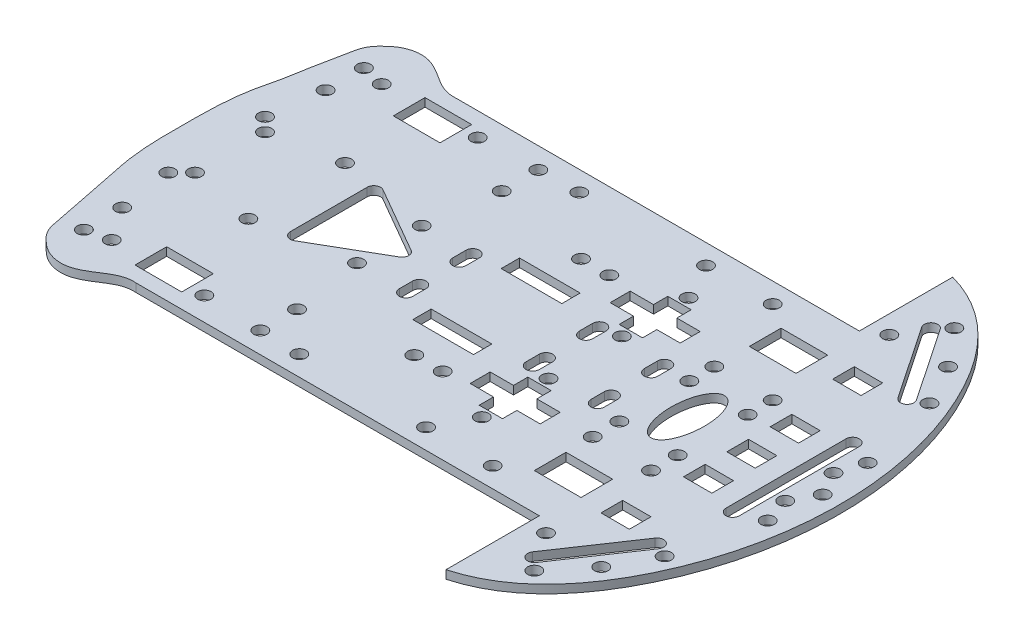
from build123d import *

# Parameters (mm, degrees)
BOSS_EXTRUDE1_DEPTH = 2.5
FILLET2_R           = 9
SKETCH3_R           = 2
SKETCH3_RX          = 11
SKETCH3_RY          = 5
SKETCH3_W           = 14
SKETCH3_H           = 9.5
SKETCH3_W_2         = 8.5
SKETCH3_H_2         = 6.5
SKETCH3_W_3         = 18.2
SKETCH3_H_3         = 5.5
CUT_EXTRUDE1_DEPTH  = 199.515326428


with BuildPart() as part:
    # Sketch2 → Boss-Extrude1 (new body)
    with BuildSketch(Plane(origin=(0, 0, 0), x_dir=(1, 0, 0), z_dir=(0, 1, 0))):
        with BuildLine():
            Line((0, 0), (0, 28))
            add(Edge.make_bspline(
                [(0, 28), (15.189399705, 23.811462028), (45.536224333, -13.31742354), (45.536224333, -82.68257646), (15.189399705, -119.811462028), (0, -124)],
                knots=[0, 0, 0, 0, 0.249322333, 0.750677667, 1, 1, 1, 1], degree=3))
            Line((0, -124), (0, -96))
            Line((0, -96), (-121, -96))
            add(Edge.make_bspline(
                [(-121, -96), (-125.039930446, -95.644363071), (-129.189599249, -99.327279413), (-135.157729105, -102.160238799), (-139.453949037, -102.149940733), (-143.956697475, -100.430031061), (-146.397781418, -97.536696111), (-148, -96)],
                knots=[0, 0, 0, 0, 0.36047898, 0.538085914, 0.637028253, 0.777922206, 1, 1, 1, 1], degree=3))
            add(Edge.make_bspline(
                [(-148, 0), (-148.687274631, -3.329271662), (-149.625450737, -8.341456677), (-151.115447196, -15.235939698), (-151.794292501, -20.300808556), (-153.102029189, -25.234575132), (-154.935896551, -34.221392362), (-155.020069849, -47.993214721), (-155.012610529, -61.796016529), (-152.978344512, -70.997166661), (-152.005800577, -76.00075893), (-150.998453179, -80.999797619), (-149.66769788, -87.666801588), (-148.66615106, -92.666599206), (-148, -96)],
                knots=[0, 0, 0, 0, 0.104865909, 0.157298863, 0.217561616, 0.262212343, 0.314645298, 0.500023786, 0.685402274, 0.737835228, 0.790268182, 0.842701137, 0.895134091, 1, 1, 1, 1], degree=3))
            add(Edge.make_bspline(
                [(-121, 0), (-125.039930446, -0.355636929), (-129.189599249, 3.327279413), (-135.157729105, 6.160238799), (-139.453949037, 6.149940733), (-143.956697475, 4.430031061), (-146.397781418, 1.536696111), (-148, 0)],
                knots=[0, 0, 0, 0, 0.36047898, 0.538085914, 0.637028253, 0.777922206, 1, 1, 1, 1], degree=3))
            Line((-121, 0), (0, 0))
        make_face()
    extrude(amount=BOSS_EXTRUDE1_DEPTH)

    # Fillet2
    fillet2_edges = [part.edges().sort_by_distance(p)[0] for p in [
        (-148, 1.25, 0),
        (-148, 1.25, 96),
    ]]
    fillet(fillet2_edges, radius=FILLET2_R)

    # Sketch3 → Cut-Extrude1 (cut, through all)
    with BuildSketch(Plane.XZ):
        with Locations(Location((29.309857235, 87.727938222, 0), (0, 0, 270))):
            Circle(SKETCH3_R)
        with Locations(Location((22.590790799, 100.01020781, 0), (0, 0, 270))):
            Circle(SKETCH3_R)
        with Locations(Location((13.5, 111, 0), (0, 0, 270))):
            Circle(SKETCH3_R)
        with Locations(Location((5.5, 99.5, 0), (0, 0, 270))):
            Circle(SKETCH3_R)
        with Locations(Location((35.5, 63, 0), (0, 0, 270))):
            Circle(SKETCH3_R)
        with Locations(Location((33, 55.25, 0), (0, 0, 270))):
            Circle(SKETCH3_R)
        with Locations(Location((37, 48, 0), (0, 0, 270))):
            Circle(SKETCH3_R)
        with Locations(Location((-20, 90, 0), (0, 0, 270))):
            Circle(SKETCH3_R)
        with Locations(Location((-40, 90, 0), (0, 0, 270))):
            Circle(SKETCH3_R)
        with Locations(Location((-34.25, 79, 0), (0, 0, 270))):
            Circle(SKETCH3_R)
        with Locations(Location((-52, 73, 0), (0, 0, 270))):
            Circle(SKETCH3_R)
        with Locations(Location((-60.5, 73, 0), (0, 0, 270))):
            Circle(SKETCH3_R)
        with Locations(Location((-78, 90, 0), (0, 0, 270))):
            Circle(SKETCH3_R)
        with Locations(Location((-34.25, 59, 0), (0, 0, 270))):
            Circle(SKETCH3_R)
        with Locations(Location((5, 67.499997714, 0), (0, 0, 270))):
            Circle(SKETCH3_R)
        with Locations(Location((5, 59.499997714, 0), (0, 0, 270))):
            Circle(SKETCH3_R)
        with Locations(Location((-12.5, 67.5, 0), (0, 0, 270))):
            Circle(SKETCH3_R)
        with Locations(Location((-12.5, 59.5, 0), (0, 0, 270))):
            Circle(SKETCH3_R)
        with Locations(Location((-90, 89.7, 0), (0, 0, 270))):
            Circle(SKETCH3_R)
        with Locations(Location((-90, 78.7, 0), (0, 0, 270))):
            Circle(SKETCH3_R)
        with Locations(Location((-107.5, 89, 0), (0, 0, 270))):
            Circle(SKETCH3_R)
        with Locations(Location((-93, 57.7, 0), (0, 0, 270))):
            Circle(SKETCH3_R)
        with Locations(Location((-120.8, 62.5, 0), (0, 0, 270))):
            Circle(SKETCH3_R)
        with Locations(Location((-142.637397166, 90, 0), (0, 0, 270))):
            Circle(SKETCH3_R)
        with Locations(Location((-135.8, 88.5, 0), (0, 0, 270))):
            Circle(SKETCH3_R)
        with Locations(Location((-142.637397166, 78.5, 0), (0, 0, 270))):
            Circle(SKETCH3_R)
        with Locations(Location((-144.8, 62.5, 0), (0, 0, 270))):
            Circle(SKETCH3_R)
        with Locations(Location((-140.8, 58.5, 0), (0, 0, 270))):
            Circle(SKETCH3_R)
        with Locations(Location((5.5, -3.5, 0), (0, 0, 90))):
            Circle(SKETCH3_R)
        with Locations(Location((13.5, -15, 0), (0, 0, 90))):
            Circle(SKETCH3_R)
        with Locations(Location((22.590790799, -4.01020781, 0), (0, 0, 90))):
            Circle(SKETCH3_R)
        with Locations(Location((29.309857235, 8.272061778, 0), (0, 0, 90))):
            Circle(SKETCH3_R)
        with Locations(Location((33, 40.75, 0), (0, 0, 90))):
            Circle(SKETCH3_R)
        with Locations(Location((35.5, 33, 0), (0, 0, 90))):
            Circle(SKETCH3_R)
        with Locations(Location((4.992855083, 30.999997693, 0), (0, 0, 90))):
            Circle(SKETCH3_R)
        with Locations(Location((4.999531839, 38.499994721, 0), (0, 0, 90))):
            Circle(SKETCH3_R)
        with Locations(Location((-12.500446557, 38.499997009, 0), (0, 0, 90))):
            Circle(SKETCH3_R)
        with Locations(Location((-12.507144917, 31, 0), (0, 0, 90))):
            Circle(SKETCH3_R)
        with Locations(Location((-20, 6, 0), (0, 0, 90))):
            Circle(SKETCH3_R)
        with Locations(Location((-40, 6, 0), (0, 0, 90))):
            Circle(SKETCH3_R)
        with Locations(Location((-34.25, 17, 0), (0, 0, 90))):
            Circle(SKETCH3_R)
        with Locations(Location((-34.25, 37, 0), (0, 0, 90))):
            Circle(SKETCH3_R)
        with Locations(Location((-52, 23, 0), (0, 0, 90))):
            Circle(SKETCH3_R)
        with Locations(Location((-60.5, 23, 0), (0, 0, 90))):
            Circle(SKETCH3_R)
        with Locations(Location((-93, 38.3, 0), (0, 0, 90))):
            Circle(SKETCH3_R)
        with Locations(Location((-78, 6, 0), (0, 0, 90))):
            Circle(SKETCH3_R)
        with Locations(Location((-90, 6.3, 0), (0, 0, 90))):
            Circle(SKETCH3_R)
        with Locations(Location((-90, 17.3, 0), (0, 0, 90))):
            Circle(SKETCH3_R)
        with Locations(Location((-107.5, 7, 0), (0, 0, 90))):
            Circle(SKETCH3_R)
        with Locations(Location((-120.8, 33.5, 0), (0, 0, 90))):
            Circle(SKETCH3_R)
        with Locations(Location((-140.8, 37.5, 0), (0, 0, 90))):
            Circle(SKETCH3_R)
        with Locations(Location((-144.8, 33.5, 0), (0, 0, 90))):
            Circle(SKETCH3_R)
        with Locations(Location((-142.637397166, 17.5, 0), (0, 0, 90))):
            Circle(SKETCH3_R)
        with Locations(Location((-135.8, 7.5, 0), (0, 0, 90))):
            Circle(SKETCH3_R)
        with Locations(Location((-142.637397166, 6, 0), (0, 0, 90))):
            Circle(SKETCH3_R)
        with Locations(Location((-3.5, 48), (0, 0, 90))):
            Ellipse(SKETCH3_RX, SKETCH3_RY)
        with Locations((-5.5, 80.25)):
            Rectangle(SKETCH3_W, SKETCH3_H)
        with Locations((12.75, 82.75)):
            Rectangle(SKETCH3_W_2, SKETCH3_H_2)
        with BuildLine():
            Line((11.658075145, 108.618385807), (26.476687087, 86.648890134))
            ThreePointArc((26.476687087, 86.648890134), (25.936997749, 83.872429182), (23.160536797, 84.41211852))
            Line((23.160536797, 84.41211852), (8.341924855, 106.381614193))
            ThreePointArc((8.341924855, 106.381614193), (8.881614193, 109.158075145), (11.658075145, 108.618385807))
        make_face()
        with BuildLine():
            Line((26, 30), (26, 66))
            ThreePointArc((26, 66), (28, 68), (30, 66))
            Line((30, 66), (30, 30))
            ThreePointArc((30, 30), (28, 28), (26, 30))
        make_face()
        with Locations((15.75, 48)):
            Rectangle(SKETCH3_W_2, SKETCH3_H_2)
        with Locations((15.75, 61)):
            Rectangle(SKETCH3_W_2, SKETCH3_H_2)
        with BuildLine():
            Line((-38, 58), (-38, 54))
            ThreePointArc((-38, 54), (-40, 52), (-42, 54))
            Line((-42, 54), (-42, 58))
            ThreePointArc((-42, 58), (-40, 60), (-38, 58))
        make_face()
        with BuildLine():
            Line((-18.5, 58), (-18.5, 54))
            ThreePointArc((-18.5, 54), (-20.5, 52), (-22.5, 54))
            Line((-22.5, 54), (-22.5, 58))
            ThreePointArc((-22.5, 58), (-20.5, 60), (-18.5, 58))
        make_face()
        with BuildLine():
            Line((-76, 58), (-76, 54))
            ThreePointArc((-76, 54), (-78, 52), (-80, 54))
            Line((-80, 54), (-80, 58))
            ThreePointArc((-80, 58), (-78, 60), (-76, 58))
        make_face()
        Polygon((-37.75, 66), (-37.75, 61.7), (-30.75, 61.7), (-30.75, 66), (-23.75, 66), (-23.75, 72), (-30.75, 72), (-30.75, 76.3), (-37.75, 76.3), (-37.75, 72), (-44.75, 72), (-44.75, 66), align=None)
        with Locations((-60.85, 61.25)):
            Rectangle(SKETCH3_W_3, SKETCH3_H_3)
        with Locations((-118.8, 86.75)):
            Rectangle(SKETCH3_W, SKETCH3_H)
        Polygon((-23.75, 24), (-23.75, 30), (-30.75, 30), (-30.75, 34.3), (-37.75, 34.3), (-37.75, 30), (-44.75, 30), (-44.75, 24), (-37.75, 24), (-37.75, 19.7), (-30.75, 19.7), (-30.75, 24), align=None)
        with BuildLine():
            Line((-111.17986928, 59.535898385), (-111.17986928, 36.464101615))
            ThreePointArc((-111.17986928, 36.464101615), (-110.17986928, 34.732050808), (-108.17986928, 34.732050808))
            Line((-108.17986928, 34.732050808), (-88.199107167, 46.267949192))
            ThreePointArc((-88.199107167, 46.267949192), (-87.199107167, 48), (-88.199107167, 49.732050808))
            Line((-88.199107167, 49.732050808), (-108.17986928, 61.267949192))
            ThreePointArc((-108.17986928, 61.267949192), (-110.17986928, 61.267949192), (-111.17986928, 59.535898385))
        make_face()
        with BuildLine():
            Line((11.658075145, -12.618385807), (26.476687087, 9.351109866))
            ThreePointArc((26.476687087, 9.351109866), (25.936997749, 12.127570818), (23.160536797, 11.58788148))
            Line((23.160536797, 11.58788148), (8.341924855, -10.381614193))
            ThreePointArc((8.341924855, -10.381614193), (8.881614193, -13.158075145), (11.658075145, -12.618385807))
        make_face()
        with Locations((12.75, 13.25)):
            Rectangle(SKETCH3_W_2, SKETCH3_H_2)
        with Locations((15.75, 35)):
            Rectangle(SKETCH3_W_2, SKETCH3_H_2)
        with BuildLine():
            Line((-18.5, 38), (-18.5, 42))
            ThreePointArc((-18.5, 42), (-20.5, 44), (-22.5, 42))
            Line((-22.5, 42), (-22.5, 38))
            ThreePointArc((-22.5, 38), (-20.5, 36), (-18.5, 38))
        make_face()
        with Locations((-5.5, 15.75)):
            Rectangle(SKETCH3_W, SKETCH3_H)
        with BuildLine():
            Line((-38, 38), (-38, 42))
            ThreePointArc((-38, 42), (-40, 44), (-42, 42))
            Line((-42, 42), (-42, 38))
            ThreePointArc((-42, 38), (-40, 36), (-38, 38))
        make_face()
        with Locations((-60.85, 34.75)):
            Rectangle(SKETCH3_W_3, SKETCH3_H_3)
        with BuildLine():
            Line((-76, 38), (-76, 42))
            ThreePointArc((-76, 42), (-78, 44), (-80, 42))
            Line((-80, 42), (-80, 38))
            ThreePointArc((-80, 38), (-78, 36), (-76, 38))
        make_face()
        with Locations((-118.8, 9.25)):
            Rectangle(SKETCH3_W, SKETCH3_H)
    extrude(amount=-CUT_EXTRUDE1_DEPTH, mode=Mode.SUBTRACT)


solid = part.part
